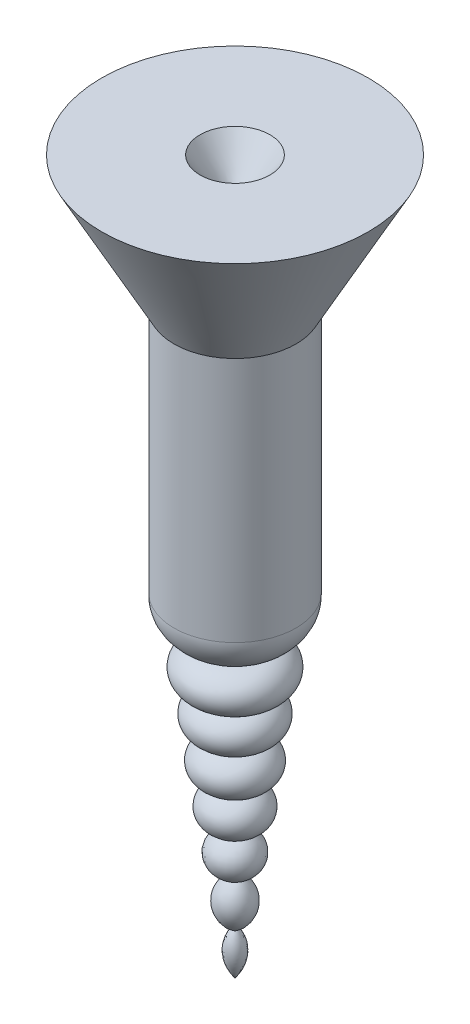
ISO-10303-21;
HEADER;
FILE_DESCRIPTION(('STEP AP214'),'2;1');
FILE_NAME('part.step','',(''),(''),'','','');
FILE_SCHEMA(('AUTOMOTIVE_DESIGN { 1 0 10303 214 1 1 1 1 }'));
ENDSEC;
DATA;
#1=APPLICATION_CONTEXT('core data for automotive mechanical design processes');
#2=APPLICATION_PROTOCOL_DEFINITION('international standard','automotive_design',2000,#1);
#3=PRODUCT_CONTEXT('',#1,'mechanical');
#4=PRODUCT('Part','Part','',(#3));
#5=PRODUCT_RELATED_PRODUCT_CATEGORY('part','',(#4));
#6=PRODUCT_DEFINITION_FORMATION('','',#4);
#7=PRODUCT_DEFINITION_CONTEXT('part definition',#1,'design');
#8=PRODUCT_DEFINITION('design','',#6,#7);
#9=PRODUCT_DEFINITION_SHAPE('','',#8);
#10=(LENGTH_UNIT() NAMED_UNIT(*) SI_UNIT(.MILLI.,.METRE.));
#11=(NAMED_UNIT(*) PLANE_ANGLE_UNIT() SI_UNIT($,.RADIAN.));
#12=(NAMED_UNIT(*) SI_UNIT($,.STERADIAN.) SOLID_ANGLE_UNIT());
#13=UNCERTAINTY_MEASURE_WITH_UNIT(LENGTH_MEASURE(1.E-05),#10,'distance_accuracy_value','');
#14=(GEOMETRIC_REPRESENTATION_CONTEXT(3) GLOBAL_UNCERTAINTY_ASSIGNED_CONTEXT((#13)) GLOBAL_UNIT_ASSIGNED_CONTEXT((#10,
#11,#12)) REPRESENTATION_CONTEXT('',''));
#15=CARTESIAN_POINT('',(0.,0.,0.));
#16=DIRECTION('',(0.,0.,1.));
#17=DIRECTION('',(1.,0.,0.));
#18=AXIS2_PLACEMENT_3D('',#15,#16,#17);
#19=CARTESIAN_POINT('',(2.38124999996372,0.875180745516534,0.));
#20=DIRECTION('',(0.,-1.,0.));
#21=DIRECTION('',(0.,0.,-1.));
#22=AXIS2_PLACEMENT_3D('',#19,#20,#21);
#23=PLANE('',#22);
#24=CARTESIAN_POINT('',(0.,0.875180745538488,0.));
#25=DIRECTION('',(0.,1.,0.));
#26=DIRECTION('',(0.,0.,1.));
#27=AXIS2_PLACEMENT_3D('',#24,#25,#26);
#28=CIRCLE('',#27,0.623803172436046);
#29=CARTESIAN_POINT('',(0.,0.875180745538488,0.623803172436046));
#30=VERTEX_POINT('',#29);
#31=EDGE_CURVE('E11',#30,#30,#28,.T.);
#32=ORIENTED_EDGE('',*,*,#31,.F.);
#33=EDGE_LOOP('',(#32));
#34=FACE_BOUND('',#33,.T.);
#35=CARTESIAN_POINT('',(0.,0.875180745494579,0.));
#36=DIRECTION('',(0.,1.,0.));
#37=DIRECTION('',(0.,0.,1.));
#38=AXIS2_PLACEMENT_3D('',#35,#36,#37);
#39=CIRCLE('',#38,2.38124999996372);
#40=CARTESIAN_POINT('',(0.,0.875180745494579,2.38124999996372));
#41=VERTEX_POINT('',#40);
#42=EDGE_CURVE('E53',#41,#41,#39,.T.);
#43=ORIENTED_EDGE('',*,*,#42,.T.);
#44=EDGE_LOOP('',(#43));
#45=FACE_BOUND('',#44,.T.);
#46=ADVANCED_FACE('F30',(#34,#45),#23,.F.);
#47=CARTESIAN_POINT('',(0.,0.875180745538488,0.));
#48=DIRECTION('',(0.,1.,0.));
#49=DIRECTION('',(0.,0.,1.));
#50=AXIS2_PLACEMENT_3D('',#47,#48,#49);
#51=CONICAL_SURFACE('',#50,0.623803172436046,0.619245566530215);
#52=CARTESIAN_POINT('',(0.,0.,0.));
#53=VERTEX_POINT('',#52);
#54=VERTEX_LOOP('',#53);
#55=FACE_BOUND('',#54,.T.);
#56=ORIENTED_EDGE('',*,*,#31,.T.);
#57=EDGE_LOOP('',(#56));
#58=FACE_BOUND('',#57,.T.);
#59=ADVANCED_FACE('F43',(#55,#58),#51,.F.);
#60=CARTESIAN_POINT('',(-2.05464931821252,-11.5654371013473,0.));
#61=DIRECTION('',(0.,0.,1.));
#62=DIRECTION('',(0.996346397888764,0.0854040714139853,0.));
#63=AXIS2_PLACEMENT_3D('',#60,#61,#62);
#64=ELLIPSE('',#63,2.22369935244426,1.1213695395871);
#65=TRIMMED_CURVE('',#64,(PARAMETER_VALUE(5.85419564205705)),
(PARAMETER_VALUE(6.62577758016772)),.T.,.PARAMETER.);
#66=CARTESIAN_POINT('',(0.,0.,0.));
#67=DIRECTION('',(0.,1.,0.));
#68=AXIS1_PLACEMENT('',#66,#67);
#69=SURFACE_OF_REVOLUTION('',#65,#68);
#70=CARTESIAN_POINT('',(0.,-11.0874995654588,0.));
#71=DIRECTION('',(0.,1.,0.));
#72=DIRECTION('',(0.,0.,1.));
#73=AXIS2_PLACEMENT_3D('',#70,#71,#72);
#74=CIRCLE('',#73,0.0571700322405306);
#75=CARTESIAN_POINT('',(0.,-11.0874995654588,0.0571700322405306));
#76=VERTEX_POINT('',#75);
#77=EDGE_CURVE('E37',#76,#76,#74,.T.);
#78=ORIENTED_EDGE('',*,*,#77,.F.);
#79=EDGE_LOOP('',(#78));
#80=FACE_BOUND('',#79,.T.);
#81=CARTESIAN_POINT('',(0.,-11.8574647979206,0.));
#82=VERTEX_POINT('',#81);
#83=VERTEX_LOOP('',#82);
#84=FACE_BOUND('',#83,.T.);
#85=ADVANCED_FACE('F46',(#80,#84),#69,.T.);
#86=CARTESIAN_POINT('',(-0.393207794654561,-10.6585171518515,0.));
#87=DIRECTION('',(0.,0.,1.));
#88=DIRECTION('',(-1.,1.23860716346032E-13,0.));
#89=AXIS2_PLACEMENT_3D('',#86,#87,#88);
#90=ELLIPSE('',#89,0.700271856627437,0.560217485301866);
#91=TRIMMED_CURVE('',#90,(PARAMETER_VALUE(2.16700263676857)),
(PARAMETER_VALUE(4.11618267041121)),.T.,.PARAMETER.);
#92=CARTESIAN_POINT('',(0.,0.,0.));
#93=DIRECTION('',(0.,1.,0.));
#94=AXIS1_PLACEMENT('',#92,#93);
#95=SURFACE_OF_REVOLUTION('',#91,#94);
#96=CARTESIAN_POINT('',(0.,-10.2711015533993,0.));
#97=DIRECTION('',(0.,1.,0.));
#98=DIRECTION('',(0.,0.,1.));
#99=AXIS2_PLACEMENT_3D('',#96,#97,#98);
#100=CIRCLE('',#99,0.112621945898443);
#101=CARTESIAN_POINT('',(0.,-10.2711015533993,0.112621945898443));
#102=VERTEX_POINT('',#101);
#103=EDGE_CURVE('E81',#102,#102,#100,.T.);
#104=ORIENTED_EDGE('',*,*,#103,.F.);
#105=EDGE_LOOP('',(#104));
#106=FACE_BOUND('',#105,.T.);
#107=ORIENTED_EDGE('',*,*,#77,.T.);
#108=EDGE_LOOP('',(#107));
#109=FACE_BOUND('',#108,.T.);
#110=ADVANCED_FACE('F86',(#106,#109),#95,.T.);
#111=CARTESIAN_POINT('',(-0.0730251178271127,-9.90749558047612,0.));
#112=DIRECTION('',(0.,0.,1.));
#113=DIRECTION('',(1.,0.,0.));
#114=AXIS2_PLACEMENT_3D('',#111,#112,#113);
#115=ELLIPSE('',#114,0.490960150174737,0.392768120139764);
#116=TRIMMED_CURVE('',#115,(PARAMETER_VALUE(4.8616823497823)),
(PARAMETER_VALUE(7.70468826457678)),.T.,.PARAMETER.);
#117=CARTESIAN_POINT('',(0.,0.,0.));
#118=DIRECTION('',(0.,1.,0.));
#119=AXIS1_PLACEMENT('',#117,#118);
#120=SURFACE_OF_REVOLUTION('',#116,#119);
#121=CARTESIAN_POINT('',(0.,-9.56515719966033,0.));
#122=DIRECTION('',(0.,1.,0.));
#123=DIRECTION('',(0.,0.,1.));
#124=AXIS2_PLACEMENT_3D('',#121,#122,#123);
#125=CIRCLE('',#124,0.167648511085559);
#126=CARTESIAN_POINT('',(0.,-9.56515719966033,0.167648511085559));
#127=VERTEX_POINT('',#126);
#128=EDGE_CURVE('E78',#127,#127,#125,.T.);
#129=ORIENTED_EDGE('',*,*,#128,.F.);
#130=EDGE_LOOP('',(#129));
#131=FACE_BOUND('',#130,.T.);
#132=ORIENTED_EDGE('',*,*,#103,.T.);
#133=EDGE_LOOP('',(#132));
#134=FACE_BOUND('',#133,.T.);
#135=ADVANCED_FACE('F93',(#131,#134),#120,.T.);
#136=CARTESIAN_POINT('',(0.0615339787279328,-9.19820686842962,0.));
#137=DIRECTION('',(0.,0.,1.));
#138=DIRECTION('',(-1.,4.64260929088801E-13,0.));
#139=AXIS2_PLACEMENT_3D('',#136,#137,#138);
#140=ELLIPSE('',#139,0.470802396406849,0.376641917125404);
#141=TRIMMED_CURVE('',#140,(PARAMETER_VALUE(1.43972109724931)),
(PARAMETER_VALUE(4.84346420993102)),.T.,.PARAMETER.);
#142=CARTESIAN_POINT('',(0.,0.,0.));
#143=DIRECTION('',(0.,1.,0.));
#144=AXIS1_PLACEMENT('',#142,#143);
#145=SURFACE_OF_REVOLUTION('',#141,#144);
#146=CARTESIAN_POINT('',(0.,-8.85440107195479,0.));
#147=DIRECTION('',(0.,1.,0.));
#148=DIRECTION('',(0.,0.,1.));
#149=AXIS2_PLACEMENT_3D('',#146,#147,#148);
#150=CIRCLE('',#149,0.253793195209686);
#151=CARTESIAN_POINT('',(0.,-8.85440107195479,0.253793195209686));
#152=VERTEX_POINT('',#151);
#153=EDGE_CURVE('E75',#152,#152,#150,.T.);
#154=ORIENTED_EDGE('',*,*,#153,.F.);
#155=EDGE_LOOP('',(#154));
#156=FACE_BOUND('',#155,.T.);
#157=ORIENTED_EDGE('',*,*,#128,.T.);
#158=EDGE_LOOP('',(#157));
#159=FACE_BOUND('',#158,.T.);
#160=ADVANCED_FACE('F108',(#156,#159),#145,.T.);
#161=CARTESIAN_POINT('',(0.178213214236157,-8.49084383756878,0.));
#162=DIRECTION('',(0.,0.,1.));
#163=DIRECTION('',(-1.,5.12108153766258E-13,0.));
#164=AXIS2_PLACEMENT_3D('',#161,#162,#163);
#165=ELLIPSE('',#164,0.460688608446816,0.368550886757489);
#166=TRIMMED_CURVE('',#165,(PARAMETER_VALUE(1.17359297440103)),
(PARAMETER_VALUE(5.10959233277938)),.T.,.PARAMETER.);
#167=CARTESIAN_POINT('',(0.,0.,0.));
#168=DIRECTION('',(0.,1.,0.));
#169=AXIS1_PLACEMENT('',#167,#168);
#170=SURFACE_OF_REVOLUTION('',#166,#169);
#171=CARTESIAN_POINT('',(0.,-8.13106506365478,0.));
#172=DIRECTION('',(0.,1.,0.));
#173=DIRECTION('',(0.,0.,1.));
#174=AXIS2_PLACEMENT_3D('',#171,#172,#173);
#175=CIRCLE('',#174,0.278127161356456);
#176=CARTESIAN_POINT('',(0.,-8.13106506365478,0.278127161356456));
#177=VERTEX_POINT('',#176);
#178=EDGE_CURVE('E72',#177,#177,#175,.T.);
#179=ORIENTED_EDGE('',*,*,#178,.F.);
#180=EDGE_LOOP('',(#179));
#181=FACE_BOUND('',#180,.T.);
#182=ORIENTED_EDGE('',*,*,#153,.T.);
#183=EDGE_LOOP('',(#182));
#184=FACE_BOUND('',#183,.T.);
#185=ADVANCED_FACE('F112',(#181,#184),#170,.T.);
#186=CARTESIAN_POINT('',(0.266182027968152,-7.76573911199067,0.));
#187=DIRECTION('',(0.,0.,1.));
#188=DIRECTION('',(1.,4.25313544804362E-12,0.));
#189=AXIS2_PLACEMENT_3D('',#186,#187,#188);
#190=ELLIPSE('',#189,0.456813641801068,0.365450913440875);
#191=TRIMMED_CURVE('',#190,(PARAMETER_VALUE(4.09035075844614)),
(PARAMETER_VALUE(8.47601985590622)),.T.,.PARAMETER.);
#192=CARTESIAN_POINT('',(0.,0.,0.));
#193=DIRECTION('',(0.,1.,0.));
#194=AXIS1_PLACEMENT('',#192,#193);
#195=SURFACE_OF_REVOLUTION('',#191,#194);
#196=CARTESIAN_POINT('',(0.,-7.41919660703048,0.));
#197=DIRECTION('',(0.,1.,0.));
#198=DIRECTION('',(0.,0.,1.));
#199=AXIS2_PLACEMENT_3D('',#196,#197,#198);
#200=CIRCLE('',#199,0.411217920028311);
#201=CARTESIAN_POINT('',(0.,-7.41919660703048,0.411217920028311));
#202=VERTEX_POINT('',#201);
#203=EDGE_CURVE('E69',#202,#202,#200,.T.);
#204=ORIENTED_EDGE('',*,*,#203,.F.);
#205=EDGE_LOOP('',(#204));
#206=FACE_BOUND('',#205,.T.);
#207=ORIENTED_EDGE('',*,*,#178,.T.);
#208=EDGE_LOOP('',(#207));
#209=FACE_BOUND('',#208,.T.);
#210=ADVANCED_FACE('F116',(#206,#209),#195,.T.);
#211=CARTESIAN_POINT('',(0.388748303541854,-7.04377474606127,0.));
#212=DIRECTION('',(0.,0.,1.));
#213=DIRECTION('',(-1.,1.62463608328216E-13,0.));
#214=AXIS2_PLACEMENT_3D('',#211,#212,#213);
#215=ELLIPSE('',#214,0.469814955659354,0.375851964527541);
#216=TRIMMED_CURVE('',#215,(PARAMETER_VALUE(0.59624535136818)),
(PARAMETER_VALUE(5.68693995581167)),.T.,.PARAMETER.);
#217=CARTESIAN_POINT('',(0.,0.,0.));
#218=DIRECTION('',(0.,1.,0.));
#219=AXIS1_PLACEMENT('',#217,#218);
#220=SURFACE_OF_REVOLUTION('',#216,#219);
#221=CARTESIAN_POINT('',(0.,-6.67033313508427,0.));
#222=DIRECTION('',(0.,1.,0.));
#223=DIRECTION('',(0.,0.,1.));
#224=AXIS2_PLACEMENT_3D('',#221,#222,#223);
#225=CIRCLE('',#224,0.335626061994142);
#226=CARTESIAN_POINT('',(0.,-6.67033313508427,0.335626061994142));
#227=VERTEX_POINT('',#226);
#228=EDGE_CURVE('E66',#227,#227,#225,.T.);
#229=ORIENTED_EDGE('',*,*,#228,.F.);
#230=EDGE_LOOP('',(#229));
#231=FACE_BOUND('',#230,.T.);
#232=ORIENTED_EDGE('',*,*,#203,.T.);
#233=EDGE_LOOP('',(#232));
#234=FACE_BOUND('',#233,.T.);
#235=ADVANCED_FACE('F123',(#231,#234),#220,.T.);
#236=CARTESIAN_POINT('',(0.142347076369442,-5.92766360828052,0.));
#237=DIRECTION('',(0.,0.,1.));
#238=DIRECTION('',(1.,0.,0.));
#239=AXIS2_PLACEMENT_3D('',#236,#237,#238);
#240=ELLIPSE('',#239,0.94824373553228,0.758594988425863);
#241=TRIMMED_CURVE('',#240,(PARAMETER_VALUE(4.56170282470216)),
(PARAMETER_VALUE(8.00466778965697)),.T.,.PARAMETER.);
#242=CARTESIAN_POINT('',(0.,0.,0.));
#243=DIRECTION('',(0.,1.,0.));
#244=AXIS1_PLACEMENT('',#242,#243);
#245=SURFACE_OF_REVOLUTION('',#241,#244);
#246=CARTESIAN_POINT('',(0.,-5.89992650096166,0.));
#247=DIRECTION('',(0.,1.,0.));
#248=DIRECTION('',(0.,0.,1.));
#249=AXIS2_PLACEMENT_3D('',#246,#247,#248);
#250=CIRCLE('',#249,1.08995674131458);
#251=CARTESIAN_POINT('',(0.,-5.89992650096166,1.08995674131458));
#252=VERTEX_POINT('',#251);
#253=EDGE_CURVE('E58',#252,#252,#250,.T.);
#254=ORIENTED_EDGE('',*,*,#253,.F.);
#255=EDGE_LOOP('',(#254));
#256=FACE_BOUND('',#255,.T.);
#257=ORIENTED_EDGE('',*,*,#228,.T.);
#258=EDGE_LOOP('',(#257));
#259=FACE_BOUND('',#258,.T.);
#260=ADVANCED_FACE('F126',(#256,#259),#245,.T.);
#261=CARTESIAN_POINT('',(0.,0.,0.));
#262=DIRECTION('',(0.,1.,0.));
#263=DIRECTION('',(0.,0.,1.));
#264=AXIS2_PLACEMENT_3D('',#261,#262,#263);
#265=CYLINDRICAL_SURFACE('',#264,1.08995674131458);
#266=CARTESIAN_POINT('',(0.,-1.5056867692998,0.));
#267=DIRECTION('',(0.,1.,0.));
#268=DIRECTION('',(0.,0.,1.));
#269=AXIS2_PLACEMENT_3D('',#266,#267,#268);
#270=CIRCLE('',#269,1.08995674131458);
#271=CARTESIAN_POINT('',(0.,-1.5056867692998,1.08995674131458));
#272=VERTEX_POINT('',#271);
#273=EDGE_CURVE('E55',#272,#272,#270,.T.);
#274=ORIENTED_EDGE('',*,*,#273,.F.);
#275=EDGE_LOOP('',(#274));
#276=FACE_BOUND('',#275,.T.);
#277=ORIENTED_EDGE('',*,*,#253,.T.);
#278=EDGE_LOOP('',(#277));
#279=FACE_BOUND('',#278,.T.);
#280=ADVANCED_FACE('F130',(#276,#279),#265,.T.);
#281=CARTESIAN_POINT('',(0.,-1.5056867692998,0.));
#282=DIRECTION('',(0.,1.,0.));
#283=DIRECTION('',(0.,0.,1.));
#284=AXIS2_PLACEMENT_3D('',#281,#282,#283);
#285=CONICAL_SURFACE('',#284,1.08995674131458,0.496960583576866);
#286=ORIENTED_EDGE('',*,*,#42,.F.);
#287=EDGE_LOOP('',(#286));
#288=FACE_BOUND('',#287,.T.);
#289=ORIENTED_EDGE('',*,*,#273,.T.);
#290=EDGE_LOOP('',(#289));
#291=FACE_BOUND('',#290,.T.);
#292=ADVANCED_FACE('F134',(#288,#291),#285,.T.);
#293=CLOSED_SHELL('',(#46,#59,#85,#110,#135,#160,#185,#210,#235,#260,#280,#292));
#294=MANIFOLD_SOLID_BREP('B2',#293);
#295=ADVANCED_BREP_SHAPE_REPRESENTATION('',(#18,#294),#14);
#296=SHAPE_DEFINITION_REPRESENTATION(#9,#295);
ENDSEC;
END-ISO-10303-21;
